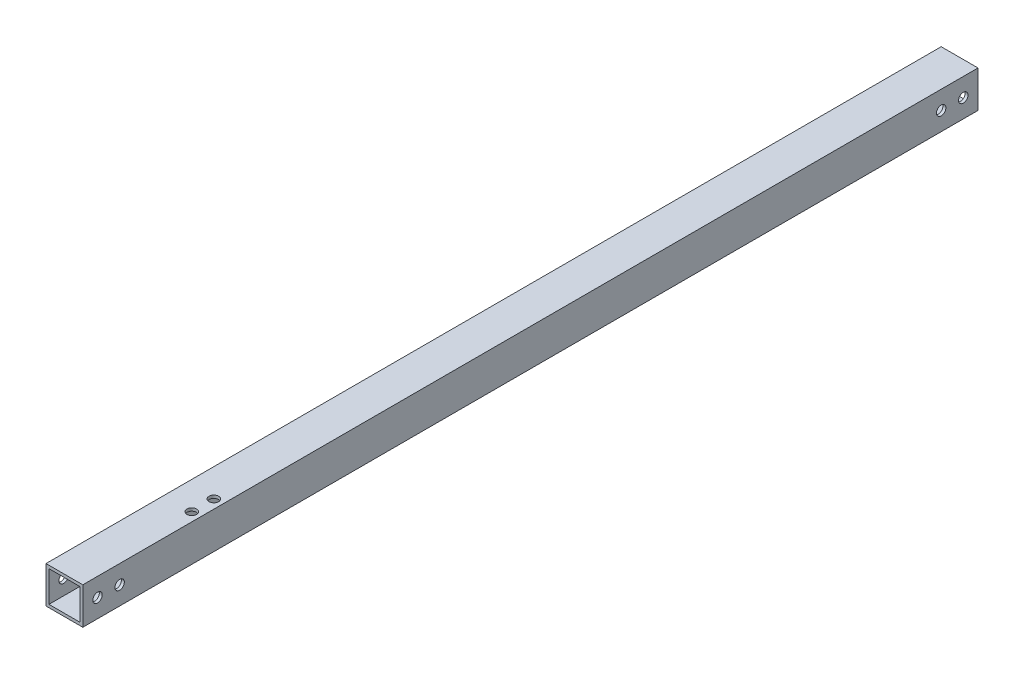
from build123d import *

# Parameters (mm, degrees)
ESQUISSE1_W             = 25
ESQUISSE1_H             = 25
ESQUISSE1_W_2           = 21
ESQUISSE1_H_2           = 21
BOSS_EXTRU_1_DEPTH      = 608
ESQUISSE2_R             = 3.2
ENL_V_MAT_EXTRU_1_DEPTH = 609.642136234
ESQUISSE3_R             = 3.25
ENL_V_MAT_EXTRU_2_DEPTH = 30


with BuildPart() as part:
    # Esquisse1 → Boss.-Extru.1 (new body)
    with BuildSketch(Plane.XY):
        Rectangle(ESQUISSE1_W, ESQUISSE1_H)
        Rectangle(ESQUISSE1_W_2, ESQUISSE1_H_2, mode=Mode.SUBTRACT)
    extrude(amount=-BOSS_EXTRU_1_DEPTH)

    # Esquisse2 → Enl_v. mat.-Extru.1 (cut, through all)
    with BuildSketch(Plane.ZY.offset(12.5)):
        with Locations(Location((-598, 0, 0), (0, 0, 270))):
            Circle(ESQUISSE2_R)
        with Locations(Location((-583, 0, 0), (0, 0, 270))):
            Circle(ESQUISSE2_R)
        with Locations(Location((-10, 0, 0), (0, 0, 270))):
            Circle(ESQUISSE2_R)
        with Locations(Location((-25, 0, 0), (0, 0, 270))):
            Circle(ESQUISSE2_R)
    extrude(amount=-ENL_V_MAT_EXTRU_1_DEPTH, mode=Mode.SUBTRACT)

    # Esquisse3 → Enl_v. mat.-Extru.2 (cut)
    with BuildSketch(Plane.XZ.offset(12.5)):
        with Locations(Location((6.5, -95, 0), (0, 0, 270))):
            Circle(ESQUISSE3_R)
        with Locations(Location((6.5, -80, 0), (0, 0, 270))):
            Circle(ESQUISSE3_R)
    extrude(amount=-ENL_V_MAT_EXTRU_2_DEPTH, mode=Mode.SUBTRACT)


solid = part.part
